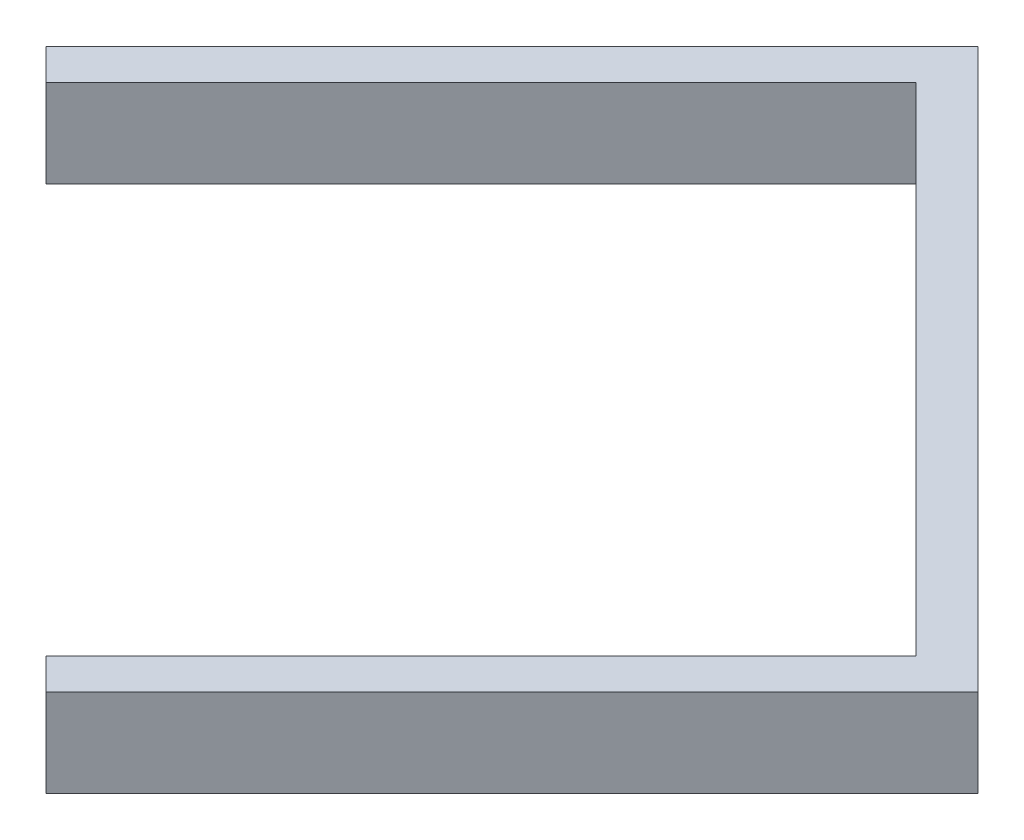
from build123d import *

# Parameters (mm, degrees)
BOSS_EXTRUDE2_DEPTH = 50.8
SKETCH3_R           = 6.35
CUT_EXTRUDE1_DEPTH  = 50.8


with BuildPart() as part:
    # Sketch2 → Boss-Extrude2 (new body)
    with BuildSketch(Plane(origin=(0, 0, 0), x_dir=(1, 0, 0), z_dir=(0, 1, 0))):
        Polygon((-60.538157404, 299.252996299), (-311.985328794, 47.805824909), (-329.945841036, 65.766337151), (-60.538157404, 335.174020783), (262.751062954, 11.884800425), (-6.656620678, -257.522883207), (-24.61713292, -239.562370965), (226.83003847, 11.884800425), align=None)
    extrude(amount=BOSS_EXTRUDE2_DEPTH)

    # Sketch3 → Cut-Extrude1 (cut)
    with BuildSketch(Plane(origin=(137.31793169, 0, -137.31793169), x_dir=(-0.7071067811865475, 0, -0.7071067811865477), z_dir=(0.7071067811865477, 0, -0.7071067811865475))):
        with Locations((0, 25.4)):
            Circle(SKETCH3_R)
    extrude(amount=-CUT_EXTRUDE1_DEPTH, mode=Mode.SUBTRACT)


solid = part.part
